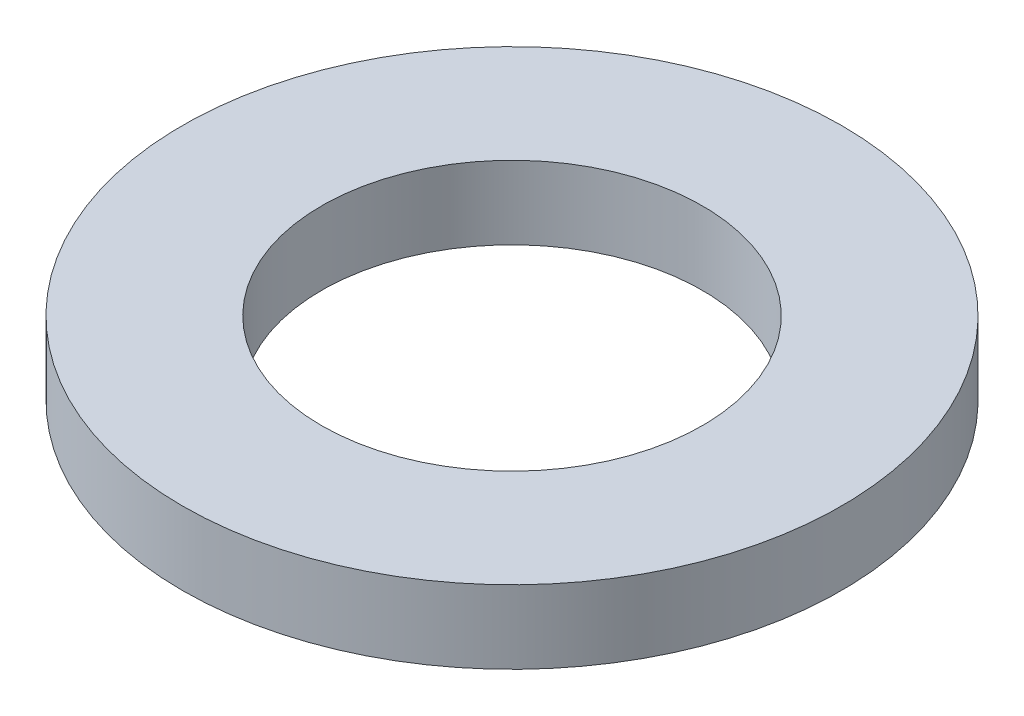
from build123d import *

# Parameters (mm, degrees)
ESQUISSE2_R      = 22.5
ESQUISSE2_R_2    = 13
EXTRUSION1_DEPTH = 5


with BuildPart() as part:
    # Esquisse2 → Extrusion1 (new body)
    with BuildSketch(Plane(origin=(0, 0, 0), x_dir=(1, 0, 0), z_dir=(0, 1, 0))):
        with Locations(Location((0, 0, 0), (0, 0, 270))):
            Circle(ESQUISSE2_R)
        with Locations(Location((0, 0, 0), (0, 0, 270))):
            Circle(ESQUISSE2_R_2, mode=Mode.SUBTRACT)
    extrude(amount=EXTRUSION1_DEPTH)


solid = part.part
